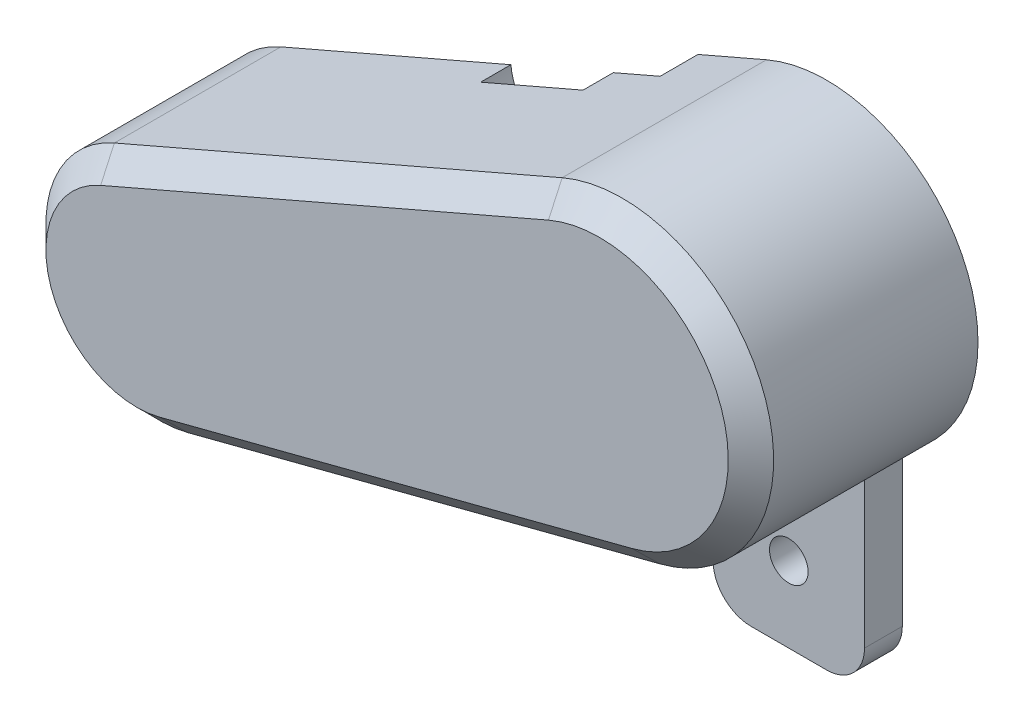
from build123d import *

# Parameters (mm, degrees)
BOSS_EXTRUDE1_DEPTH = 3
BOSS_EXTRUDE2_START = 27
BOSS_EXTRUDE2_DEPTH = 27
CHAMFER1_SIZE       = 3
CUT_EXTRUDE1_DEPTH  = 5
SKETCH4_3_R         = 7.75
CUT_EXTRUDE2_DEPTH  = 4
SKETCH7_R           = 2.55
BOSS_EXTRUDE5_DEPTH = 5


with BuildPart() as part:
    # Sketch2 → Boss-Extrude1 (new body)
    with BuildSketch(Plane.XY.offset(27)):
        with BuildLine():
            Line((-48.107762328, -39.75057759), (11.056310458, -14.145221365))
            ThreePointArc((11.056310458, -14.145221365), (37.914072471, -25.999413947), (24.018554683, -51.86011478))
            Line((24.018554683, -51.86011478), (-38.38607916, -68.036747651))
            ThreePointArc((-38.38607916, -68.036747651), (-56.335559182, -58.392101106), (-48.107762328, -39.75057759))
        make_face()
    extrude(amount=BOSS_EXTRUDE1_DEPTH)

    # Sketch3 → Boss-Extrude2 (add)
    with BuildSketch(Plane(origin=(0, 0, 27), x_dir=(-1, 0, 0), z_dir=(0, 0, -1)).offset(BOSS_EXTRUDE2_START)):
        with BuildLine():
            Line((48.107762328, -39.75057759), (-11.056310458, -14.145221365))
            ThreePointArc((-11.056310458, -14.145221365), (-37.914072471, -25.999413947), (-24.018554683, -51.86011478))
            Line((-24.018554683, -51.86011478), (38.38607916, -68.036747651))
            ThreePointArc((38.38607916, -68.036747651), (56.335559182, -58.392101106), (48.107762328, -39.75057759))
        make_face()
        with BuildLine():
            Line((46.916209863, -42.503794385), (-12.247862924, -16.89843816))
            ThreePointArc((-12.247862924, -16.89843816), (-35.076960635, -26.974501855), (-23.265770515, -48.956097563))
            Line((-23.265770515, -48.956097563), (39.138863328, -65.132730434))
            ThreePointArc((39.138863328, -65.132730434), (53.498447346, -57.417013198), (46.916209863, -42.503794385))
        make_face(mode=Mode.SUBTRACT)
    extrude(amount=-BOSS_EXTRUDE2_DEPTH)

    # Chamfer1
    chamfer1_edges = [part.edges().sort_by_distance(p)[0] for p in [
        (37.914072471, -25.999413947, 30),
        (-18.525725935, -26.947899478, 30),
        (-53.498447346, -57.417013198, 27),
        (-17.334173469, -29.701116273, 27),
        (35.076960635, -26.974501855, 27),
        (-7.936546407, -57.044413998, 27),
        (-56.335559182, -58.392101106, 30),
        (-7.183762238, -59.948431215, 30),
    ]]
    chamfer(chamfer1_edges, length=CHAMFER1_SIZE)

    # Sketch4 → Cut-Extrude1 (cut)
    with BuildSketch(Plane.XY.offset(5)):
        Polygon((-63.676072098, -10.5), (1.999993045, -10.5), (2.000000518, -39.366661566), (-18, -39.366661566), (-18, -71.666661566), (-63.676072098, -71.666661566), align=None)
    extrude(amount=-CUT_EXTRUDE1_DEPTH, mode=Mode.SUBTRACT)

    # Sketch4_3 → Cut-Extrude2 (cut)
    with BuildSketch(Plane.XY.offset(5)):
        with Locations((-10, -25.866661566)):
            Circle(SKETCH4_3_R)
    extrude(amount=CUT_EXTRUDE2_DEPTH, mode=Mode.SUBTRACT)

    # Sketch7 → Boss-Extrude5 (add)
    with BuildSketch(Plane(origin=(0, 0, 0), x_dir=(-1, 0, 0), z_dir=(0, 0, -1))):
        with BuildLine():
            Line((-8.999993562, -55.753251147), (-8.999993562, -70))
            ThreePointArc((-8.999993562, -70), (-10.464459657, -73.535533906), (-13.999993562, -75))
            Line((-13.999993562, -75), (-23.999993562, -75))
            ThreePointArc((-23.999993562, -75), (-27.535527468, -73.535533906), (-28.999993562, -70))
            Line((-28.999993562, -70), (-28.999993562, -49.820508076))
            ThreePointArc((-28.999993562, -49.820508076), (-26.578205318, -51.008665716), (-24.018554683, -51.86011478))
            Line((-24.018554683, -51.86011478), (-8.999993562, -55.753251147))
        make_face()
        with Locations((-18.999993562, -65)):
            Circle(SKETCH7_R, mode=Mode.SUBTRACT)
    extrude(amount=-BOSS_EXTRUDE5_DEPTH)


solid = part.part
